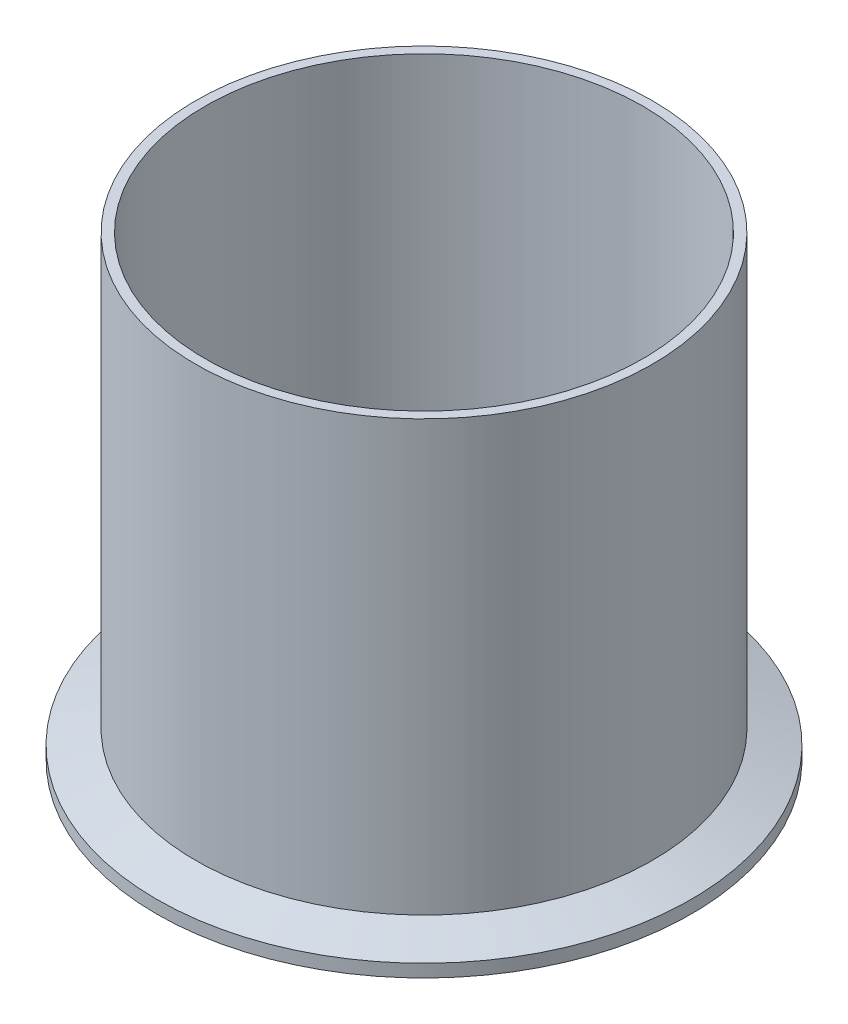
ISO-10303-21;
HEADER;
FILE_DESCRIPTION(('STEP AP214'),'2;1');
FILE_NAME('part.step','',(''),(''),'','','');
FILE_SCHEMA(('AUTOMOTIVE_DESIGN { 1 0 10303 214 1 1 1 1 }'));
ENDSEC;
DATA;
#1=APPLICATION_CONTEXT('core data for automotive mechanical design processes');
#2=APPLICATION_PROTOCOL_DEFINITION('international standard','automotive_design',2000,#1);
#3=PRODUCT_CONTEXT('',#1,'mechanical');
#4=PRODUCT('Part','Part','',(#3));
#5=PRODUCT_RELATED_PRODUCT_CATEGORY('part','',(#4));
#6=PRODUCT_DEFINITION_FORMATION('','',#4);
#7=PRODUCT_DEFINITION_CONTEXT('part definition',#1,'design');
#8=PRODUCT_DEFINITION('design','',#6,#7);
#9=PRODUCT_DEFINITION_SHAPE('','',#8);
#10=(LENGTH_UNIT() NAMED_UNIT(*) SI_UNIT(.MILLI.,.METRE.));
#11=(NAMED_UNIT(*) PLANE_ANGLE_UNIT() SI_UNIT($,.RADIAN.));
#12=(NAMED_UNIT(*) SI_UNIT($,.STERADIAN.) SOLID_ANGLE_UNIT());
#13=UNCERTAINTY_MEASURE_WITH_UNIT(LENGTH_MEASURE(1.E-05),#10,'distance_accuracy_value','');
#14=(GEOMETRIC_REPRESENTATION_CONTEXT(3) GLOBAL_UNCERTAINTY_ASSIGNED_CONTEXT((#13)) GLOBAL_UNIT_ASSIGNED_CONTEXT((#10,
#11,#12)) REPRESENTATION_CONTEXT('',''));
#15=CARTESIAN_POINT('',(0.,0.,0.));
#16=DIRECTION('',(0.,0.,1.));
#17=DIRECTION('',(1.,0.,0.));
#18=AXIS2_PLACEMENT_3D('',#15,#16,#17);
#19=CARTESIAN_POINT('',(0.,0.7874,0.));
#20=DIRECTION('',(0.,-1.,0.));
#21=DIRECTION('',(0.,0.,-1.));
#22=AXIS2_PLACEMENT_3D('',#19,#20,#21);
#23=TOROIDAL_SURFACE('',#22,56.6185084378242,0.787400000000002);
#24=CARTESIAN_POINT('',(0.,0.,0.));
#25=DIRECTION('',(0.,-1.,0.));
#26=DIRECTION('',(0.,0.,-1.));
#27=AXIS2_PLACEMENT_3D('',#24,#25,#26);
#28=CIRCLE('',#27,56.6185084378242);
#29=CARTESIAN_POINT('',(0.,0.,-56.6185084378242));
#30=VERTEX_POINT('',#29);
#31=EDGE_CURVE('E66',#30,#30,#28,.T.);
#32=ORIENTED_EDGE('',*,*,#31,.T.);
#33=EDGE_LOOP('',(#32));
#34=FACE_BOUND('',#33,.T.);
#35=CARTESIAN_POINT('',(0.,0.474458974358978,0.));
#36=DIRECTION('',(0.,-1.,0.));
#37=DIRECTION('',(0.,0.,-1.));
#38=AXIS2_PLACEMENT_3D('',#35,#36,#37);
#39=CIRCLE('',#38,55.8959666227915);
#40=CARTESIAN_POINT('',(0.,0.474458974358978,-55.8959666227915));
#41=VERTEX_POINT('',#40);
#42=EDGE_CURVE('E10',#41,#41,#39,.T.);
#43=ORIENTED_EDGE('',*,*,#42,.F.);
#44=EDGE_LOOP('',(#43));
#45=FACE_BOUND('',#44,.T.);
#46=ADVANCED_FACE('F32',(#34,#45),#23,.T.);
#47=CARTESIAN_POINT('',(0.,0.,0.));
#48=DIRECTION('',(0.,-1.,0.));
#49=DIRECTION('',(0.,0.,-1.));
#50=AXIS2_PLACEMENT_3D('',#47,#48,#49);
#51=TOROIDAL_SURFACE('',#50,54.8005,1.1938);
#52=CARTESIAN_POINT('',(0.,0.474458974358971,0.));
#53=DIRECTION('',(0.,-1.,0.));
#54=DIRECTION('',(0.,0.,-1.));
#55=AXIS2_PLACEMENT_3D('',#52,#53,#54);
#56=CIRCLE('',#55,53.7050333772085);
#57=CARTESIAN_POINT('',(0.,0.474458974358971,-53.7050333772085));
#58=VERTEX_POINT('',#57);
#59=EDGE_CURVE('E38',#58,#58,#56,.T.);
#60=ORIENTED_EDGE('',*,*,#59,.F.);
#61=EDGE_LOOP('',(#60));
#62=FACE_BOUND('',#61,.T.);
#63=ORIENTED_EDGE('',*,*,#42,.T.);
#64=EDGE_LOOP('',(#63));
#65=FACE_BOUND('',#64,.T.);
#66=ADVANCED_FACE('F114',(#62,#65),#51,.F.);
#67=CARTESIAN_POINT('',(0.,0.7874,0.));
#68=DIRECTION('',(0.,-1.,0.));
#69=DIRECTION('',(0.,0.,-1.));
#70=AXIS2_PLACEMENT_3D('',#67,#68,#69);
#71=TOROIDAL_SURFACE('',#70,52.9824915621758,0.787399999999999);
#72=ORIENTED_EDGE('',*,*,#59,.T.);
#73=EDGE_LOOP('',(#72));
#74=FACE_BOUND('',#73,.T.);
#75=CARTESIAN_POINT('',(0.,0.,0.));
#76=DIRECTION('',(0.,-1.,0.));
#77=DIRECTION('',(0.,0.,-1.));
#78=AXIS2_PLACEMENT_3D('',#75,#76,#77);
#79=CIRCLE('',#78,52.9824915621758);
#80=CARTESIAN_POINT('',(0.,0.,-52.9824915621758));
#81=VERTEX_POINT('',#80);
#82=EDGE_CURVE('E42',#81,#81,#79,.T.);
#83=ORIENTED_EDGE('',*,*,#82,.F.);
#84=EDGE_LOOP('',(#83));
#85=FACE_BOUND('',#84,.T.);
#86=ADVANCED_FACE('F110',(#74,#85),#71,.T.);
#87=CARTESIAN_POINT('',(0.,0.,0.));
#88=DIRECTION('',(0.,1.,0.));
#89=DIRECTION('',(0.,0.,1.));
#90=AXIS2_PLACEMENT_3D('',#87,#88,#89);
#91=PLANE('',#90);
#92=CARTESIAN_POINT('',(0.,0.,0.));
#93=DIRECTION('',(0.,-1.,0.));
#94=DIRECTION('',(0.,0.,-1.));
#95=AXIS2_PLACEMENT_3D('',#92,#93,#94);
#96=CIRCLE('',#95,48.6918);
#97=CARTESIAN_POINT('',(0.,0.,-48.6918));
#98=VERTEX_POINT('',#97);
#99=EDGE_CURVE('E46',#98,#98,#96,.T.);
#100=ORIENTED_EDGE('',*,*,#99,.F.);
#101=EDGE_LOOP('',(#100));
#102=FACE_BOUND('',#101,.T.);
#103=ORIENTED_EDGE('',*,*,#82,.T.);
#104=EDGE_LOOP('',(#103));
#105=FACE_BOUND('',#104,.T.);
#106=ADVANCED_FACE('F104',(#102,#105),#91,.F.);
#107=CARTESIAN_POINT('',(0.,0.,0.));
#108=DIRECTION('',(0.,-1.,0.));
#109=DIRECTION('',(0.,0.,-1.));
#110=AXIS2_PLACEMENT_3D('',#107,#108,#109);
#111=CYLINDRICAL_SURFACE('',#110,48.6918);
#112=ORIENTED_EDGE('',*,*,#99,.T.);
#113=EDGE_LOOP('',(#112));
#114=FACE_BOUND('',#113,.T.);
#115=CARTESIAN_POINT('',(0.,101.6,0.));
#116=DIRECTION('',(0.,-1.,0.));
#117=DIRECTION('',(0.,0.,-1.));
#118=AXIS2_PLACEMENT_3D('',#115,#116,#117);
#119=CIRCLE('',#118,48.6918);
#120=CARTESIAN_POINT('',(0.,101.6,-48.6918));
#121=VERTEX_POINT('',#120);
#122=EDGE_CURVE('E51',#121,#121,#119,.T.);
#123=ORIENTED_EDGE('',*,*,#122,.F.);
#124=EDGE_LOOP('',(#123));
#125=FACE_BOUND('',#124,.T.);
#126=ADVANCED_FACE('F99',(#114,#125),#111,.F.);
#127=CARTESIAN_POINT('',(0.,101.6,0.));
#128=DIRECTION('',(0.,-1.,0.));
#129=DIRECTION('',(0.,0.,-1.));
#130=AXIS2_PLACEMENT_3D('',#127,#128,#129);
#131=PLANE('',#130);
#132=CARTESIAN_POINT('',(0.,101.6,0.));
#133=DIRECTION('',(0.,-1.,0.));
#134=DIRECTION('',(0.,0.,-1.));
#135=AXIS2_PLACEMENT_3D('',#132,#133,#134);
#136=CIRCLE('',#135,50.8);
#137=CARTESIAN_POINT('',(0.,101.6,-50.8));
#138=VERTEX_POINT('',#137);
#139=EDGE_CURVE('E54',#138,#138,#136,.T.);
#140=ORIENTED_EDGE('',*,*,#139,.F.);
#141=EDGE_LOOP('',(#140));
#142=FACE_BOUND('',#141,.T.);
#143=ORIENTED_EDGE('',*,*,#122,.T.);
#144=EDGE_LOOP('',(#143));
#145=FACE_BOUND('',#144,.T.);
#146=ADVANCED_FACE('F93',(#142,#145),#131,.F.);
#147=CARTESIAN_POINT('',(0.,0.,0.));
#148=DIRECTION('',(0.,-1.,0.));
#149=DIRECTION('',(0.,0.,-1.));
#150=AXIS2_PLACEMENT_3D('',#147,#148,#149);
#151=CYLINDRICAL_SURFACE('',#150,50.8);
#152=CARTESIAN_POINT('',(0.,5.99729178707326,0.));
#153=DIRECTION('',(0.,-1.,0.));
#154=DIRECTION('',(0.,0.,-1.));
#155=AXIS2_PLACEMENT_3D('',#152,#153,#154);
#156=CIRCLE('',#155,50.8);
#157=CARTESIAN_POINT('',(0.,5.99729178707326,-50.8));
#158=VERTEX_POINT('',#157);
#159=EDGE_CURVE('E57',#158,#158,#156,.T.);
#160=ORIENTED_EDGE('',*,*,#159,.F.);
#161=EDGE_LOOP('',(#160));
#162=FACE_BOUND('',#161,.T.);
#163=ORIENTED_EDGE('',*,*,#139,.T.);
#164=EDGE_LOOP('',(#163));
#165=FACE_BOUND('',#164,.T.);
#166=ADVANCED_FACE('F87',(#162,#165),#151,.T.);
#167=CARTESIAN_POINT('',(0.,5.99729178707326,0.));
#168=DIRECTION('',(0.,-1.,0.));
#169=DIRECTION('',(0.,0.,-1.));
#170=AXIS2_PLACEMENT_3D('',#167,#168,#169);
#171=CONICAL_SURFACE('',#170,50.8,1.22173047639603);
#172=CARTESIAN_POINT('',(0.,2.8448,0.));
#173=DIRECTION('',(0.,-1.,0.));
#174=DIRECTION('',(0.,0.,-1.));
#175=AXIS2_PLACEMENT_3D('',#172,#173,#174);
#176=CIRCLE('',#175,59.4614);
#177=CARTESIAN_POINT('',(0.,2.8448,-59.4614));
#178=VERTEX_POINT('',#177);
#179=EDGE_CURVE('E60',#178,#178,#176,.T.);
#180=ORIENTED_EDGE('',*,*,#179,.F.);
#181=EDGE_LOOP('',(#180));
#182=FACE_BOUND('',#181,.T.);
#183=ORIENTED_EDGE('',*,*,#159,.T.);
#184=EDGE_LOOP('',(#183));
#185=FACE_BOUND('',#184,.T.);
#186=ADVANCED_FACE('F81',(#182,#185),#171,.T.);
#187=CARTESIAN_POINT('',(0.,0.,0.));
#188=DIRECTION('',(0.,-1.,0.));
#189=DIRECTION('',(0.,0.,-1.));
#190=AXIS2_PLACEMENT_3D('',#187,#188,#189);
#191=CYLINDRICAL_SURFACE('',#190,59.4614);
#192=CARTESIAN_POINT('',(0.,0.,0.));
#193=DIRECTION('',(0.,-1.,0.));
#194=DIRECTION('',(0.,0.,-1.));
#195=AXIS2_PLACEMENT_3D('',#192,#193,#194);
#196=CIRCLE('',#195,59.4614);
#197=CARTESIAN_POINT('',(0.,0.,-59.4614));
#198=VERTEX_POINT('',#197);
#199=EDGE_CURVE('E63',#198,#198,#196,.T.);
#200=ORIENTED_EDGE('',*,*,#199,.F.);
#201=EDGE_LOOP('',(#200));
#202=FACE_BOUND('',#201,.T.);
#203=ORIENTED_EDGE('',*,*,#179,.T.);
#204=EDGE_LOOP('',(#203));
#205=FACE_BOUND('',#204,.T.);
#206=ADVANCED_FACE('F75',(#202,#205),#191,.T.);
#207=CARTESIAN_POINT('',(0.,0.,0.));
#208=DIRECTION('',(0.,1.,0.));
#209=DIRECTION('',(0.,0.,1.));
#210=AXIS2_PLACEMENT_3D('',#207,#208,#209);
#211=PLANE('',#210);
#212=ORIENTED_EDGE('',*,*,#31,.F.);
#213=EDGE_LOOP('',(#212));
#214=FACE_BOUND('',#213,.T.);
#215=ORIENTED_EDGE('',*,*,#199,.T.);
#216=EDGE_LOOP('',(#215));
#217=FACE_BOUND('',#216,.T.);
#218=ADVANCED_FACE('F72',(#214,#217),#211,.F.);
#219=CLOSED_SHELL('',(#46,#66,#86,#106,#126,#146,#166,#186,#206,#218));
#220=MANIFOLD_SOLID_BREP('B2',#219);
#221=ADVANCED_BREP_SHAPE_REPRESENTATION('',(#18,#220),#14);
#222=SHAPE_DEFINITION_REPRESENTATION(#9,#221);
ENDSEC;
END-ISO-10303-21;
